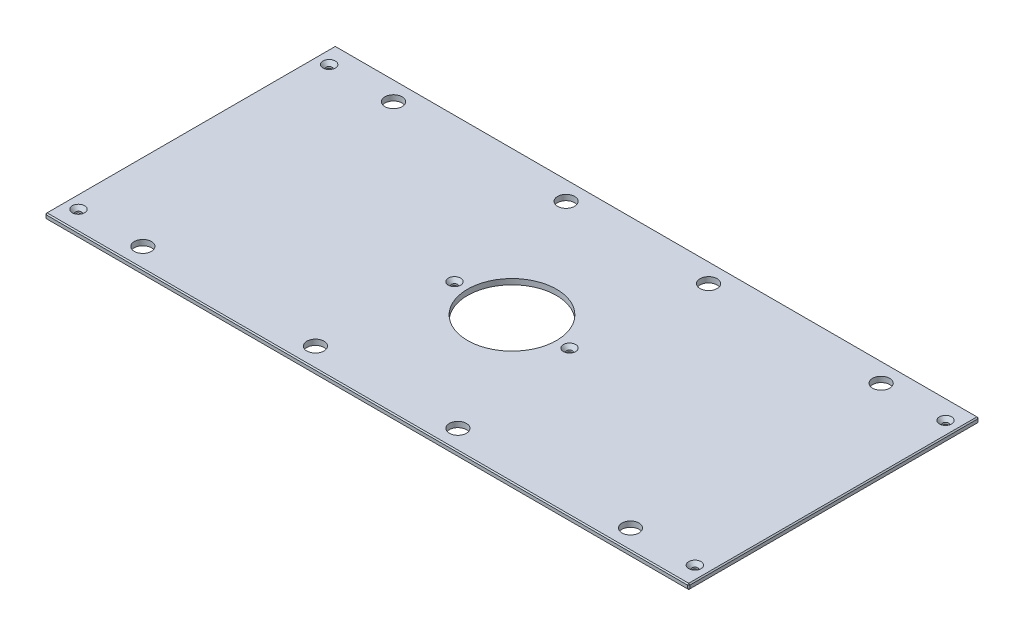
ISO-10303-21;
HEADER;
FILE_DESCRIPTION(('STEP AP214'),'2;1');
FILE_NAME('part.step','',(''),(''),'','','');
FILE_SCHEMA(('AUTOMOTIVE_DESIGN { 1 0 10303 214 1 1 1 1 }'));
ENDSEC;
DATA;
#1=APPLICATION_CONTEXT('core data for automotive mechanical design processes');
#2=APPLICATION_PROTOCOL_DEFINITION('international standard','automotive_design',2000,#1);
#3=PRODUCT_CONTEXT('',#1,'mechanical');
#4=PRODUCT('Part','Part','',(#3));
#5=PRODUCT_RELATED_PRODUCT_CATEGORY('part','',(#4));
#6=PRODUCT_DEFINITION_FORMATION('','',#4);
#7=PRODUCT_DEFINITION_CONTEXT('part definition',#1,'design');
#8=PRODUCT_DEFINITION('design','',#6,#7);
#9=PRODUCT_DEFINITION_SHAPE('','',#8);
#10=(LENGTH_UNIT() NAMED_UNIT(*) SI_UNIT(.MILLI.,.METRE.));
#11=(NAMED_UNIT(*) PLANE_ANGLE_UNIT() SI_UNIT($,.RADIAN.));
#12=(NAMED_UNIT(*) SI_UNIT($,.STERADIAN.) SOLID_ANGLE_UNIT());
#13=UNCERTAINTY_MEASURE_WITH_UNIT(LENGTH_MEASURE(1.E-05),#10,'distance_accuracy_value','');
#14=(GEOMETRIC_REPRESENTATION_CONTEXT(3) GLOBAL_UNCERTAINTY_ASSIGNED_CONTEXT((#13)) GLOBAL_UNIT_ASSIGNED_CONTEXT((#10,
#11,#12)) REPRESENTATION_CONTEXT('',''));
#15=CARTESIAN_POINT('',(0.,0.,0.));
#16=DIRECTION('',(0.,0.,1.));
#17=DIRECTION('',(1.,0.,0.));
#18=AXIS2_PLACEMENT_3D('',#15,#16,#17);
#19=CARTESIAN_POINT('',(-373.0625,6.35,-168.275));
#20=DIRECTION('',(1.,0.,0.));
#21=DIRECTION('',(0.,0.,-1.));
#22=AXIS2_PLACEMENT_3D('',#19,#20,#21);
#23=PLANE('',#22);
#24=DIRECTION('',(0.,0.,-1.));
#25=VECTOR('',#24,1.);
#26=CARTESIAN_POINT('',(-373.0625,5.08000000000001,-168.275));
#27=LINE('',#26,#25);
#28=CARTESIAN_POINT('',(-373.0625,5.08000000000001,167.005));
#29=VERTEX_POINT('',#28);
#30=CARTESIAN_POINT('',(-373.0625,5.08000000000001,-167.005));
#31=VERTEX_POINT('',#30);
#32=EDGE_CURVE('E140',#29,#31,#27,.T.);
#33=ORIENTED_EDGE('',*,*,#32,.T.);
#34=DIRECTION('',(0.,-1.,0.));
#35=VECTOR('',#34,1.);
#36=CARTESIAN_POINT('',(-373.0625,6.35,-167.005));
#37=LINE('',#36,#35);
#38=CARTESIAN_POINT('',(-373.0625,1.26999999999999,-167.005));
#39=VERTEX_POINT('',#38);
#40=EDGE_CURVE('E135',#31,#39,#37,.T.);
#41=ORIENTED_EDGE('',*,*,#40,.T.);
#42=DIRECTION('',(0.,0.,1.));
#43=VECTOR('',#42,1.);
#44=CARTESIAN_POINT('',(-373.0625,1.26999999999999,-168.275));
#45=LINE('',#44,#43);
#46=CARTESIAN_POINT('',(-373.0625,1.26999999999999,167.005));
#47=VERTEX_POINT('',#46);
#48=EDGE_CURVE('E130',#39,#47,#45,.T.);
#49=ORIENTED_EDGE('',*,*,#48,.T.);
#50=DIRECTION('',(0.,1.,0.));
#51=VECTOR('',#50,1.);
#52=CARTESIAN_POINT('',(-373.0625,6.35,167.005));
#53=LINE('',#52,#51);
#54=EDGE_CURVE('E132',#47,#29,#53,.T.);
#55=ORIENTED_EDGE('',*,*,#54,.T.);
#56=EDGE_LOOP('',(#33,#41,#49,#55));
#57=FACE_BOUND('',#56,.T.);
#58=ADVANCED_FACE('F38',(#57),#23,.F.);
#59=CARTESIAN_POINT('',(-373.0625,6.35,168.275));
#60=DIRECTION('',(0.,0.,-1.));
#61=DIRECTION('',(-1.,0.,0.));
#62=AXIS2_PLACEMENT_3D('',#59,#60,#61);
#63=PLANE('',#62);
#64=DIRECTION('',(1.,0.,0.));
#65=VECTOR('',#64,1.);
#66=CARTESIAN_POINT('',(-373.0625,1.26999999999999,168.275));
#67=LINE('',#66,#65);
#68=CARTESIAN_POINT('',(-371.7925,1.26999999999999,168.275));
#69=VERTEX_POINT('',#68);
#70=CARTESIAN_POINT('',(371.7925,1.26999999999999,168.275));
#71=VERTEX_POINT('',#70);
#72=EDGE_CURVE('E62',#69,#71,#67,.T.);
#73=ORIENTED_EDGE('',*,*,#72,.T.);
#74=DIRECTION('',(0.,1.,0.));
#75=VECTOR('',#74,1.);
#76=CARTESIAN_POINT('',(371.7925,6.35,168.275));
#77=LINE('',#76,#75);
#78=CARTESIAN_POINT('',(371.7925,5.08000000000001,168.275));
#79=VERTEX_POINT('',#78);
#80=EDGE_CURVE('E11',#71,#79,#77,.T.);
#81=ORIENTED_EDGE('',*,*,#80,.T.);
#82=DIRECTION('',(-1.,0.,0.));
#83=VECTOR('',#82,1.);
#84=CARTESIAN_POINT('',(-373.0625,5.08000000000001,168.275));
#85=LINE('',#84,#83);
#86=CARTESIAN_POINT('',(-371.7925,5.08000000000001,168.275));
#87=VERTEX_POINT('',#86);
#88=EDGE_CURVE('E48',#79,#87,#85,.T.);
#89=ORIENTED_EDGE('',*,*,#88,.T.);
#90=DIRECTION('',(0.,-1.,0.));
#91=VECTOR('',#90,1.);
#92=CARTESIAN_POINT('',(-371.7925,6.35,168.275));
#93=LINE('',#92,#91);
#94=EDGE_CURVE('E366',#87,#69,#93,.T.);
#95=ORIENTED_EDGE('',*,*,#94,.T.);
#96=EDGE_LOOP('',(#73,#81,#89,#95));
#97=FACE_BOUND('',#96,.T.);
#98=ADVANCED_FACE('F442',(#97),#63,.F.);
#99=CARTESIAN_POINT('',(373.0625,6.35,-168.275));
#100=DIRECTION('',(-1.,0.,0.));
#101=DIRECTION('',(0.,0.,1.));
#102=AXIS2_PLACEMENT_3D('',#99,#100,#101);
#103=PLANE('',#102);
#104=DIRECTION('',(0.,0.,-1.));
#105=VECTOR('',#104,1.);
#106=CARTESIAN_POINT('',(373.0625,1.26999999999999,-168.275));
#107=LINE('',#106,#105);
#108=CARTESIAN_POINT('',(373.0625,1.26999999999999,167.005));
#109=VERTEX_POINT('',#108);
#110=CARTESIAN_POINT('',(373.0625,1.26999999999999,-167.005));
#111=VERTEX_POINT('',#110);
#112=EDGE_CURVE('E359',#109,#111,#107,.T.);
#113=ORIENTED_EDGE('',*,*,#112,.T.);
#114=DIRECTION('',(0.,1.,0.));
#115=VECTOR('',#114,1.);
#116=CARTESIAN_POINT('',(373.0625,6.35,-167.005));
#117=LINE('',#116,#115);
#118=CARTESIAN_POINT('',(373.0625,5.08000000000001,-167.005));
#119=VERTEX_POINT('',#118);
#120=EDGE_CURVE('E362',#111,#119,#117,.T.);
#121=ORIENTED_EDGE('',*,*,#120,.T.);
#122=DIRECTION('',(0.,0.,1.));
#123=VECTOR('',#122,1.);
#124=CARTESIAN_POINT('',(373.0625,5.08000000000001,168.275));
#125=LINE('',#124,#123);
#126=CARTESIAN_POINT('',(373.0625,5.08000000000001,167.005));
#127=VERTEX_POINT('',#126);
#128=EDGE_CURVE('E356',#119,#127,#125,.T.);
#129=ORIENTED_EDGE('',*,*,#128,.T.);
#130=DIRECTION('',(0.,-1.,0.));
#131=VECTOR('',#130,1.);
#132=CARTESIAN_POINT('',(373.0625,6.35,167.005));
#133=LINE('',#132,#131);
#134=EDGE_CURVE('E353',#127,#109,#133,.T.);
#135=ORIENTED_EDGE('',*,*,#134,.T.);
#136=EDGE_LOOP('',(#113,#121,#129,#135));
#137=FACE_BOUND('',#136,.T.);
#138=ADVANCED_FACE('F429',(#137),#103,.F.);
#139=CARTESIAN_POINT('',(-373.0625,6.35,-168.275));
#140=DIRECTION('',(0.,0.,1.));
#141=DIRECTION('',(1.,0.,0.));
#142=AXIS2_PLACEMENT_3D('',#139,#140,#141);
#143=PLANE('',#142);
#144=DIRECTION('',(-1.,0.,0.));
#145=VECTOR('',#144,1.);
#146=CARTESIAN_POINT('',(-373.0625,1.26999999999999,-168.275));
#147=LINE('',#146,#145);
#148=CARTESIAN_POINT('',(371.7925,1.26999999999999,-168.275));
#149=VERTEX_POINT('',#148);
#150=CARTESIAN_POINT('',(-371.7925,1.26999999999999,-168.275));
#151=VERTEX_POINT('',#150);
#152=EDGE_CURVE('E320',#149,#151,#147,.T.);
#153=ORIENTED_EDGE('',*,*,#152,.T.);
#154=DIRECTION('',(0.,1.,0.));
#155=VECTOR('',#154,1.);
#156=CARTESIAN_POINT('',(-371.7925,6.35,-168.275));
#157=LINE('',#156,#155);
#158=CARTESIAN_POINT('',(-371.7925,5.08000000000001,-168.275));
#159=VERTEX_POINT('',#158);
#160=EDGE_CURVE('E326',#151,#159,#157,.T.);
#161=ORIENTED_EDGE('',*,*,#160,.T.);
#162=DIRECTION('',(1.,0.,0.));
#163=VECTOR('',#162,1.);
#164=CARTESIAN_POINT('',(373.0625,5.08000000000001,-168.275));
#165=LINE('',#164,#163);
#166=CARTESIAN_POINT('',(371.7925,5.08000000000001,-168.275));
#167=VERTEX_POINT('',#166);
#168=EDGE_CURVE('E323',#159,#167,#165,.T.);
#169=ORIENTED_EDGE('',*,*,#168,.T.);
#170=DIRECTION('',(0.,-1.,0.));
#171=VECTOR('',#170,1.);
#172=CARTESIAN_POINT('',(371.7925,6.35,-168.275));
#173=LINE('',#172,#171);
#174=EDGE_CURVE('E317',#167,#149,#173,.T.);
#175=ORIENTED_EDGE('',*,*,#174,.T.);
#176=EDGE_LOOP('',(#153,#161,#169,#175));
#177=FACE_BOUND('',#176,.T.);
#178=ADVANCED_FACE('F403',(#177),#143,.F.);
#179=CARTESIAN_POINT('',(0.,6.35,0.));
#180=DIRECTION('',(0.,1.,0.));
#181=DIRECTION('',(0.,0.,1.));
#182=AXIS2_PLACEMENT_3D('',#179,#180,#181);
#183=PLANE('',#182);
#184=CARTESIAN_POINT('',(357.1875,6.35,-145.25498));
#185=DIRECTION('',(0.,1.,0.));
#186=DIRECTION('',(0.,0.,1.));
#187=AXIS2_PLACEMENT_3D('',#184,#185,#186);
#188=CIRCLE('',#187,7.13740000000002);
#189=CARTESIAN_POINT('',(357.1875,6.35,-138.11758));
#190=VERTEX_POINT('',#189);
#191=EDGE_CURVE('E974',#190,#190,#188,.T.);
#192=ORIENTED_EDGE('',*,*,#191,.F.);
#193=EDGE_LOOP('',(#192));
#194=FACE_BOUND('',#193,.T.);
#195=CARTESIAN_POINT('',(357.1875,6.35,145.25498));
#196=DIRECTION('',(0.,1.,0.));
#197=DIRECTION('',(0.,0.,1.));
#198=AXIS2_PLACEMENT_3D('',#195,#196,#197);
#199=CIRCLE('',#198,7.13740000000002);
#200=CARTESIAN_POINT('',(357.1875,6.35,152.39238));
#201=VERTEX_POINT('',#200);
#202=EDGE_CURVE('E978',#201,#201,#199,.T.);
#203=ORIENTED_EDGE('',*,*,#202,.F.);
#204=EDGE_LOOP('',(#203));
#205=FACE_BOUND('',#204,.T.);
#206=CARTESIAN_POINT('',(-357.1875,6.35,145.25498));
#207=DIRECTION('',(0.,1.,0.));
#208=DIRECTION('',(0.,0.,1.));
#209=AXIS2_PLACEMENT_3D('',#206,#207,#208);
#210=CIRCLE('',#209,7.13740000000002);
#211=CARTESIAN_POINT('',(-357.1875,6.35,152.39238));
#212=VERTEX_POINT('',#211);
#213=EDGE_CURVE('E982',#212,#212,#210,.T.);
#214=ORIENTED_EDGE('',*,*,#213,.F.);
#215=EDGE_LOOP('',(#214));
#216=FACE_BOUND('',#215,.T.);
#217=CARTESIAN_POINT('',(-66.675,6.35,0.));
#218=DIRECTION('',(0.,1.,0.));
#219=DIRECTION('',(0.,0.,1.));
#220=AXIS2_PLACEMENT_3D('',#217,#218,#219);
#221=CIRCLE('',#220,7.1374);
#222=CARTESIAN_POINT('',(-66.675,6.35,7.1374));
#223=VERTEX_POINT('',#222);
#224=EDGE_CURVE('E986',#223,#223,#221,.T.);
#225=ORIENTED_EDGE('',*,*,#224,.F.);
#226=EDGE_LOOP('',(#225));
#227=FACE_BOUND('',#226,.T.);
#228=CARTESIAN_POINT('',(66.675,6.35,0.));
#229=DIRECTION('',(0.,1.,0.));
#230=DIRECTION('',(0.,0.,1.));
#231=AXIS2_PLACEMENT_3D('',#228,#229,#230);
#232=CIRCLE('',#231,7.1374);
#233=CARTESIAN_POINT('',(66.675,6.35,7.1374));
#234=VERTEX_POINT('',#233);
#235=EDGE_CURVE('E990',#234,#234,#232,.T.);
#236=ORIENTED_EDGE('',*,*,#235,.F.);
#237=EDGE_LOOP('',(#236));
#238=FACE_BOUND('',#237,.T.);
#239=CARTESIAN_POINT('',(-357.1875,6.35,-145.25498));
#240=DIRECTION('',(0.,1.,0.));
#241=DIRECTION('',(0.,0.,1.));
#242=AXIS2_PLACEMENT_3D('',#239,#240,#241);
#243=CIRCLE('',#242,7.13740000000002);
#244=CARTESIAN_POINT('',(-357.1875,6.35,-138.11758));
#245=VERTEX_POINT('',#244);
#246=EDGE_CURVE('E993',#245,#245,#243,.T.);
#247=ORIENTED_EDGE('',*,*,#246,.F.);
#248=EDGE_LOOP('',(#247));
#249=FACE_BOUND('',#248,.T.);
#250=DIRECTION('',(0.,0.,-1.));
#251=VECTOR('',#250,1.);
#252=CARTESIAN_POINT('',(371.7925,6.35,-168.275));
#253=LINE('',#252,#251);
#254=CARTESIAN_POINT('',(371.7925,6.35,167.005));
#255=VERTEX_POINT('',#254);
#256=CARTESIAN_POINT('',(371.7925,6.35,-167.005));
#257=VERTEX_POINT('',#256);
#258=EDGE_CURVE('E335',#255,#257,#253,.T.);
#259=ORIENTED_EDGE('',*,*,#258,.T.);
#260=DIRECTION('',(-1.,0.,0.));
#261=VECTOR('',#260,1.);
#262=CARTESIAN_POINT('',(-373.0625,6.35,-167.005));
#263=LINE('',#262,#261);
#264=CARTESIAN_POINT('',(-371.7925,6.35,-167.005));
#265=VERTEX_POINT('',#264);
#266=EDGE_CURVE('E337',#257,#265,#263,.T.);
#267=ORIENTED_EDGE('',*,*,#266,.T.);
#268=DIRECTION('',(0.,0.,1.));
#269=VECTOR('',#268,1.);
#270=CARTESIAN_POINT('',(-371.7925,6.35,168.275));
#271=LINE('',#270,#269);
#272=CARTESIAN_POINT('',(-371.7925,6.35,167.005));
#273=VERTEX_POINT('',#272);
#274=EDGE_CURVE('E332',#265,#273,#271,.T.);
#275=ORIENTED_EDGE('',*,*,#274,.T.);
#276=DIRECTION('',(1.,0.,0.));
#277=VECTOR('',#276,1.);
#278=CARTESIAN_POINT('',(373.0625,6.35,167.005));
#279=LINE('',#278,#277);
#280=EDGE_CURVE('E330',#273,#255,#279,.T.);
#281=ORIENTED_EDGE('',*,*,#280,.T.);
#282=EDGE_LOOP('',(#259,#267,#275,#281));
#283=FACE_BOUND('',#282,.T.);
#284=CARTESIAN_POINT('',(282.575,6.35,-145.25498));
#285=DIRECTION('',(0.,1.,0.));
#286=DIRECTION('',(0.,0.,1.));
#287=AXIS2_PLACEMENT_3D('',#284,#285,#286);
#288=CIRCLE('',#287,9.92187500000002);
#289=CARTESIAN_POINT('',(282.575,6.35,-135.333105));
#290=VERTEX_POINT('',#289);
#291=EDGE_CURVE('E231',#290,#290,#288,.T.);
#292=ORIENTED_EDGE('',*,*,#291,.F.);
#293=EDGE_LOOP('',(#292));
#294=FACE_BOUND('',#293,.T.);
#295=CARTESIAN_POINT('',(-282.575,6.35,-145.25498));
#296=DIRECTION('',(0.,1.,0.));
#297=DIRECTION('',(0.,0.,1.));
#298=AXIS2_PLACEMENT_3D('',#295,#296,#297);
#299=CIRCLE('',#298,9.92187500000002);
#300=CARTESIAN_POINT('',(-282.575,6.35,-135.333105));
#301=VERTEX_POINT('',#300);
#302=EDGE_CURVE('E246',#301,#301,#299,.T.);
#303=ORIENTED_EDGE('',*,*,#302,.F.);
#304=EDGE_LOOP('',(#303));
#305=FACE_BOUND('',#304,.T.);
#306=CARTESIAN_POINT('',(282.575,6.35,145.25498));
#307=DIRECTION('',(0.,1.,0.));
#308=DIRECTION('',(0.,0.,1.));
#309=AXIS2_PLACEMENT_3D('',#306,#307,#308);
#310=CIRCLE('',#309,9.92187500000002);
#311=CARTESIAN_POINT('',(282.575,6.35,155.176855));
#312=VERTEX_POINT('',#311);
#313=EDGE_CURVE('E259',#312,#312,#310,.T.);
#314=ORIENTED_EDGE('',*,*,#313,.F.);
#315=EDGE_LOOP('',(#314));
#316=FACE_BOUND('',#315,.T.);
#317=CARTESIAN_POINT('',(-282.575,6.35,145.25498));
#318=DIRECTION('',(0.,1.,0.));
#319=DIRECTION('',(0.,0.,1.));
#320=AXIS2_PLACEMENT_3D('',#317,#318,#319);
#321=CIRCLE('',#320,9.92187500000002);
#322=CARTESIAN_POINT('',(-282.575,6.35,155.176855));
#323=VERTEX_POINT('',#322);
#324=EDGE_CURVE('E267',#323,#323,#321,.T.);
#325=ORIENTED_EDGE('',*,*,#324,.F.);
#326=EDGE_LOOP('',(#325));
#327=FACE_BOUND('',#326,.T.);
#328=CARTESIAN_POINT('',(-82.55,6.35,-145.25498));
#329=DIRECTION('',(0.,1.,0.));
#330=DIRECTION('',(0.,0.,1.));
#331=AXIS2_PLACEMENT_3D('',#328,#329,#330);
#332=CIRCLE('',#331,9.921875);
#333=CARTESIAN_POINT('',(-82.55,6.35,-135.333105));
#334=VERTEX_POINT('',#333);
#335=EDGE_CURVE('E275',#334,#334,#332,.T.);
#336=ORIENTED_EDGE('',*,*,#335,.F.);
#337=EDGE_LOOP('',(#336));
#338=FACE_BOUND('',#337,.T.);
#339=CARTESIAN_POINT('',(82.55,6.35,-145.25498));
#340=DIRECTION('',(0.,1.,0.));
#341=DIRECTION('',(0.,0.,1.));
#342=AXIS2_PLACEMENT_3D('',#339,#340,#341);
#343=CIRCLE('',#342,9.921875);
#344=CARTESIAN_POINT('',(82.55,6.35,-135.333105));
#345=VERTEX_POINT('',#344);
#346=EDGE_CURVE('E283',#345,#345,#343,.T.);
#347=ORIENTED_EDGE('',*,*,#346,.F.);
#348=EDGE_LOOP('',(#347));
#349=FACE_BOUND('',#348,.T.);
#350=CARTESIAN_POINT('',(82.55,6.35,145.25498));
#351=DIRECTION('',(0.,1.,0.));
#352=DIRECTION('',(0.,0.,1.));
#353=AXIS2_PLACEMENT_3D('',#350,#351,#352);
#354=CIRCLE('',#353,9.921875);
#355=CARTESIAN_POINT('',(82.55,6.35,155.176855));
#356=VERTEX_POINT('',#355);
#357=EDGE_CURVE('E291',#356,#356,#354,.T.);
#358=ORIENTED_EDGE('',*,*,#357,.F.);
#359=EDGE_LOOP('',(#358));
#360=FACE_BOUND('',#359,.T.);
#361=CARTESIAN_POINT('',(-82.55,6.35,145.25498));
#362=DIRECTION('',(0.,1.,0.));
#363=DIRECTION('',(0.,0.,1.));
#364=AXIS2_PLACEMENT_3D('',#361,#362,#363);
#365=CIRCLE('',#364,9.921875);
#366=CARTESIAN_POINT('',(-82.55,6.35,155.176855));
#367=VERTEX_POINT('',#366);
#368=EDGE_CURVE('E299',#367,#367,#365,.T.);
#369=ORIENTED_EDGE('',*,*,#368,.F.);
#370=EDGE_LOOP('',(#369));
#371=FACE_BOUND('',#370,.T.);
#372=CARTESIAN_POINT('',(0.,6.35,0.));
#373=DIRECTION('',(0.,1.,0.));
#374=DIRECTION('',(0.,0.,1.));
#375=AXIS2_PLACEMENT_3D('',#372,#373,#374);
#376=CIRCLE('',#375,51.562);
#377=CARTESIAN_POINT('',(0.,6.35,51.562));
#378=VERTEX_POINT('',#377);
#379=EDGE_CURVE('E307',#378,#378,#376,.T.);
#380=ORIENTED_EDGE('',*,*,#379,.F.);
#381=EDGE_LOOP('',(#380));
#382=FACE_BOUND('',#381,.T.);
#383=ADVANCED_FACE('F451',(#194,#205,#216,#227,#238,#249,#283,#294,#305,#316,#327,#338,#349,
#360,#371,#382),#183,.T.);
#384=CARTESIAN_POINT('',(0.,0.,0.));
#385=DIRECTION('',(0.,1.,0.));
#386=DIRECTION('',(0.,0.,1.));
#387=AXIS2_PLACEMENT_3D('',#384,#385,#386);
#388=PLANE('',#387);
#389=CARTESIAN_POINT('',(357.1875,0.,-145.25498));
#390=DIRECTION('',(0.,1.,0.));
#391=DIRECTION('',(0.,0.,1.));
#392=AXIS2_PLACEMENT_3D('',#389,#390,#391);
#393=CIRCLE('',#392,3.3782);
#394=CARTESIAN_POINT('',(357.1875,0.,-141.87678));
#395=VERTEX_POINT('',#394);
#396=EDGE_CURVE('E1041',#395,#395,#393,.T.);
#397=ORIENTED_EDGE('',*,*,#396,.T.);
#398=EDGE_LOOP('',(#397));
#399=FACE_BOUND('',#398,.T.);
#400=CARTESIAN_POINT('',(357.1875,0.,145.25498));
#401=DIRECTION('',(0.,1.,0.));
#402=DIRECTION('',(0.,0.,1.));
#403=AXIS2_PLACEMENT_3D('',#400,#401,#402);
#404=CIRCLE('',#403,3.3782);
#405=CARTESIAN_POINT('',(357.1875,0.,148.63318));
#406=VERTEX_POINT('',#405);
#407=EDGE_CURVE('E1031',#406,#406,#404,.T.);
#408=ORIENTED_EDGE('',*,*,#407,.T.);
#409=EDGE_LOOP('',(#408));
#410=FACE_BOUND('',#409,.T.);
#411=CARTESIAN_POINT('',(-357.1875,0.,145.25498));
#412=DIRECTION('',(0.,1.,0.));
#413=DIRECTION('',(0.,0.,1.));
#414=AXIS2_PLACEMENT_3D('',#411,#412,#413);
#415=CIRCLE('',#414,3.3782);
#416=CARTESIAN_POINT('',(-357.1875,0.,148.63318));
#417=VERTEX_POINT('',#416);
#418=EDGE_CURVE('E1021',#417,#417,#415,.T.);
#419=ORIENTED_EDGE('',*,*,#418,.T.);
#420=EDGE_LOOP('',(#419));
#421=FACE_BOUND('',#420,.T.);
#422=CARTESIAN_POINT('',(-66.675,0.,0.));
#423=DIRECTION('',(0.,1.,0.));
#424=DIRECTION('',(0.,0.,1.));
#425=AXIS2_PLACEMENT_3D('',#422,#423,#424);
#426=CIRCLE('',#425,3.3782);
#427=CARTESIAN_POINT('',(-66.675,0.,3.3782));
#428=VERTEX_POINT('',#427);
#429=EDGE_CURVE('E1011',#428,#428,#426,.T.);
#430=ORIENTED_EDGE('',*,*,#429,.T.);
#431=EDGE_LOOP('',(#430));
#432=FACE_BOUND('',#431,.T.);
#433=CARTESIAN_POINT('',(66.675,0.,0.));
#434=DIRECTION('',(0.,1.,0.));
#435=DIRECTION('',(0.,0.,1.));
#436=AXIS2_PLACEMENT_3D('',#433,#434,#435);
#437=CIRCLE('',#436,3.3782);
#438=CARTESIAN_POINT('',(66.675,0.,3.3782));
#439=VERTEX_POINT('',#438);
#440=EDGE_CURVE('E997',#439,#439,#437,.T.);
#441=ORIENTED_EDGE('',*,*,#440,.T.);
#442=EDGE_LOOP('',(#441));
#443=FACE_BOUND('',#442,.T.);
#444=CARTESIAN_POINT('',(-357.1875,0.,-145.25498));
#445=DIRECTION('',(0.,1.,0.));
#446=DIRECTION('',(0.,0.,1.));
#447=AXIS2_PLACEMENT_3D('',#444,#445,#446);
#448=CIRCLE('',#447,3.3782);
#449=CARTESIAN_POINT('',(-357.1875,0.,-141.87678));
#450=VERTEX_POINT('',#449);
#451=EDGE_CURVE('E249',#450,#450,#448,.T.);
#452=ORIENTED_EDGE('',*,*,#451,.T.);
#453=EDGE_LOOP('',(#452));
#454=FACE_BOUND('',#453,.T.);
#455=DIRECTION('',(0.,0.,-1.));
#456=VECTOR('',#455,1.);
#457=CARTESIAN_POINT('',(-371.7925,0.,0.));
#458=LINE('',#457,#456);
#459=CARTESIAN_POINT('',(-371.7925,0.,167.005));
#460=VERTEX_POINT('',#459);
#461=CARTESIAN_POINT('',(-371.7925,0.,-167.005));
#462=VERTEX_POINT('',#461);
#463=EDGE_CURVE('E165',#460,#462,#458,.T.);
#464=ORIENTED_EDGE('',*,*,#463,.T.);
#465=DIRECTION('',(1.,0.,0.));
#466=VECTOR('',#465,1.);
#467=CARTESIAN_POINT('',(0.,0.,-167.005));
#468=LINE('',#467,#466);
#469=CARTESIAN_POINT('',(371.7925,0.,-167.005));
#470=VERTEX_POINT('',#469);
#471=EDGE_CURVE('E349',#462,#470,#468,.T.);
#472=ORIENTED_EDGE('',*,*,#471,.T.);
#473=DIRECTION('',(0.,0.,1.));
#474=VECTOR('',#473,1.);
#475=CARTESIAN_POINT('',(371.7925,0.,0.));
#476=LINE('',#475,#474);
#477=CARTESIAN_POINT('',(371.7925,0.,167.005));
#478=VERTEX_POINT('',#477);
#479=EDGE_CURVE('E346',#470,#478,#476,.T.);
#480=ORIENTED_EDGE('',*,*,#479,.T.);
#481=DIRECTION('',(-1.,0.,0.));
#482=VECTOR('',#481,1.);
#483=CARTESIAN_POINT('',(0.,0.,167.005));
#484=LINE('',#483,#482);
#485=EDGE_CURVE('E341',#478,#460,#484,.T.);
#486=ORIENTED_EDGE('',*,*,#485,.T.);
#487=EDGE_LOOP('',(#464,#472,#480,#486));
#488=FACE_BOUND('',#487,.T.);
#489=CARTESIAN_POINT('',(282.575,0.,-145.25498));
#490=DIRECTION('',(0.,1.,0.));
#491=DIRECTION('',(0.,0.,1.));
#492=AXIS2_PLACEMENT_3D('',#489,#490,#491);
#493=CIRCLE('',#492,9.92187500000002);
#494=CARTESIAN_POINT('',(282.575,0.,-135.333105));
#495=VERTEX_POINT('',#494);
#496=EDGE_CURVE('E239',#495,#495,#493,.T.);
#497=ORIENTED_EDGE('',*,*,#496,.T.);
#498=EDGE_LOOP('',(#497));
#499=FACE_BOUND('',#498,.T.);
#500=CARTESIAN_POINT('',(-282.575,0.,-145.25498));
#501=DIRECTION('',(0.,1.,0.));
#502=DIRECTION('',(0.,0.,1.));
#503=AXIS2_PLACEMENT_3D('',#500,#501,#502);
#504=CIRCLE('',#503,9.92187500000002);
#505=CARTESIAN_POINT('',(-282.575,0.,-135.333105));
#506=VERTEX_POINT('',#505);
#507=EDGE_CURVE('E255',#506,#506,#504,.T.);
#508=ORIENTED_EDGE('',*,*,#507,.T.);
#509=EDGE_LOOP('',(#508));
#510=FACE_BOUND('',#509,.T.);
#511=CARTESIAN_POINT('',(282.575,0.,145.25498));
#512=DIRECTION('',(0.,1.,0.));
#513=DIRECTION('',(0.,0.,1.));
#514=AXIS2_PLACEMENT_3D('',#511,#512,#513);
#515=CIRCLE('',#514,9.92187500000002);
#516=CARTESIAN_POINT('',(282.575,0.,155.176855));
#517=VERTEX_POINT('',#516);
#518=EDGE_CURVE('E263',#517,#517,#515,.T.);
#519=ORIENTED_EDGE('',*,*,#518,.T.);
#520=EDGE_LOOP('',(#519));
#521=FACE_BOUND('',#520,.T.);
#522=CARTESIAN_POINT('',(-282.575,0.,145.25498));
#523=DIRECTION('',(0.,1.,0.));
#524=DIRECTION('',(0.,0.,1.));
#525=AXIS2_PLACEMENT_3D('',#522,#523,#524);
#526=CIRCLE('',#525,9.92187500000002);
#527=CARTESIAN_POINT('',(-282.575,0.,155.176855));
#528=VERTEX_POINT('',#527);
#529=EDGE_CURVE('E271',#528,#528,#526,.T.);
#530=ORIENTED_EDGE('',*,*,#529,.T.);
#531=EDGE_LOOP('',(#530));
#532=FACE_BOUND('',#531,.T.);
#533=CARTESIAN_POINT('',(-82.55,0.,-145.25498));
#534=DIRECTION('',(0.,1.,0.));
#535=DIRECTION('',(0.,0.,1.));
#536=AXIS2_PLACEMENT_3D('',#533,#534,#535);
#537=CIRCLE('',#536,9.921875);
#538=CARTESIAN_POINT('',(-82.55,0.,-135.333105));
#539=VERTEX_POINT('',#538);
#540=EDGE_CURVE('E279',#539,#539,#537,.T.);
#541=ORIENTED_EDGE('',*,*,#540,.T.);
#542=EDGE_LOOP('',(#541));
#543=FACE_BOUND('',#542,.T.);
#544=CARTESIAN_POINT('',(82.55,0.,-145.25498));
#545=DIRECTION('',(0.,1.,0.));
#546=DIRECTION('',(0.,0.,1.));
#547=AXIS2_PLACEMENT_3D('',#544,#545,#546);
#548=CIRCLE('',#547,9.921875);
#549=CARTESIAN_POINT('',(82.55,0.,-135.333105));
#550=VERTEX_POINT('',#549);
#551=EDGE_CURVE('E287',#550,#550,#548,.T.);
#552=ORIENTED_EDGE('',*,*,#551,.T.);
#553=EDGE_LOOP('',(#552));
#554=FACE_BOUND('',#553,.T.);
#555=CARTESIAN_POINT('',(82.55,0.,145.25498));
#556=DIRECTION('',(0.,1.,0.));
#557=DIRECTION('',(0.,0.,1.));
#558=AXIS2_PLACEMENT_3D('',#555,#556,#557);
#559=CIRCLE('',#558,9.921875);
#560=CARTESIAN_POINT('',(82.55,0.,155.176855));
#561=VERTEX_POINT('',#560);
#562=EDGE_CURVE('E295',#561,#561,#559,.T.);
#563=ORIENTED_EDGE('',*,*,#562,.T.);
#564=EDGE_LOOP('',(#563));
#565=FACE_BOUND('',#564,.T.);
#566=CARTESIAN_POINT('',(-82.55,0.,145.25498));
#567=DIRECTION('',(0.,1.,0.));
#568=DIRECTION('',(0.,0.,1.));
#569=AXIS2_PLACEMENT_3D('',#566,#567,#568);
#570=CIRCLE('',#569,9.921875);
#571=CARTESIAN_POINT('',(-82.55,0.,155.176855));
#572=VERTEX_POINT('',#571);
#573=EDGE_CURVE('E303',#572,#572,#570,.T.);
#574=ORIENTED_EDGE('',*,*,#573,.T.);
#575=EDGE_LOOP('',(#574));
#576=FACE_BOUND('',#575,.T.);
#577=CARTESIAN_POINT('',(0.,0.,0.));
#578=DIRECTION('',(0.,1.,0.));
#579=DIRECTION('',(0.,0.,1.));
#580=AXIS2_PLACEMENT_3D('',#577,#578,#579);
#581=CIRCLE('',#580,51.562);
#582=CARTESIAN_POINT('',(0.,0.,51.562));
#583=VERTEX_POINT('',#582);
#584=EDGE_CURVE('E153',#583,#583,#581,.T.);
#585=ORIENTED_EDGE('',*,*,#584,.T.);
#586=EDGE_LOOP('',(#585));
#587=FACE_BOUND('',#586,.T.);
#588=ADVANCED_FACE('F416',(#399,#410,#421,#432,#443,#454,#488,#499,#510,#521,#532,#543,#554,
#565,#576,#587),#388,.F.);
#589=CARTESIAN_POINT('',(0.,0.,0.));
#590=DIRECTION('',(0.,1.,0.));
#591=DIRECTION('',(0.,0.,1.));
#592=AXIS2_PLACEMENT_3D('',#589,#590,#591);
#593=CYLINDRICAL_SURFACE('',#592,51.562);
#594=ORIENTED_EDGE('',*,*,#584,.F.);
#595=EDGE_LOOP('',(#594));
#596=FACE_BOUND('',#595,.T.);
#597=ORIENTED_EDGE('',*,*,#379,.T.);
#598=EDGE_LOOP('',(#597));
#599=FACE_BOUND('',#598,.T.);
#600=ADVANCED_FACE('F697',(#596,#599),#593,.F.);
#601=CARTESIAN_POINT('',(-82.55,6.35,145.25498));
#602=DIRECTION('',(0.,1.,0.));
#603=DIRECTION('',(0.,0.,1.));
#604=AXIS2_PLACEMENT_3D('',#601,#602,#603);
#605=CYLINDRICAL_SURFACE('',#604,9.921875);
#606=ORIENTED_EDGE('',*,*,#573,.F.);
#607=EDGE_LOOP('',(#606));
#608=FACE_BOUND('',#607,.T.);
#609=ORIENTED_EDGE('',*,*,#368,.T.);
#610=EDGE_LOOP('',(#609));
#611=FACE_BOUND('',#610,.T.);
#612=ADVANCED_FACE('F891',(#608,#611),#605,.F.);
#613=CARTESIAN_POINT('',(82.55,6.35,145.25498));
#614=DIRECTION('',(0.,1.,0.));
#615=DIRECTION('',(0.,0.,1.));
#616=AXIS2_PLACEMENT_3D('',#613,#614,#615);
#617=CYLINDRICAL_SURFACE('',#616,9.921875);
#618=ORIENTED_EDGE('',*,*,#562,.F.);
#619=EDGE_LOOP('',(#618));
#620=FACE_BOUND('',#619,.T.);
#621=ORIENTED_EDGE('',*,*,#357,.T.);
#622=EDGE_LOOP('',(#621));
#623=FACE_BOUND('',#622,.T.);
#624=ADVANCED_FACE('F881',(#620,#623),#617,.F.);
#625=CARTESIAN_POINT('',(82.55,6.35,-145.25498));
#626=DIRECTION('',(0.,1.,0.));
#627=DIRECTION('',(0.,0.,1.));
#628=AXIS2_PLACEMENT_3D('',#625,#626,#627);
#629=CYLINDRICAL_SURFACE('',#628,9.921875);
#630=ORIENTED_EDGE('',*,*,#551,.F.);
#631=EDGE_LOOP('',(#630));
#632=FACE_BOUND('',#631,.T.);
#633=ORIENTED_EDGE('',*,*,#346,.T.);
#634=EDGE_LOOP('',(#633));
#635=FACE_BOUND('',#634,.T.);
#636=ADVANCED_FACE('F871',(#632,#635),#629,.F.);
#637=CARTESIAN_POINT('',(-82.55,6.35,-145.25498));
#638=DIRECTION('',(0.,1.,0.));
#639=DIRECTION('',(0.,0.,1.));
#640=AXIS2_PLACEMENT_3D('',#637,#638,#639);
#641=CYLINDRICAL_SURFACE('',#640,9.921875);
#642=ORIENTED_EDGE('',*,*,#540,.F.);
#643=EDGE_LOOP('',(#642));
#644=FACE_BOUND('',#643,.T.);
#645=ORIENTED_EDGE('',*,*,#335,.T.);
#646=EDGE_LOOP('',(#645));
#647=FACE_BOUND('',#646,.T.);
#648=ADVANCED_FACE('F861',(#644,#647),#641,.F.);
#649=CARTESIAN_POINT('',(-282.575,6.35,145.25498));
#650=DIRECTION('',(0.,1.,0.));
#651=DIRECTION('',(0.,0.,1.));
#652=AXIS2_PLACEMENT_3D('',#649,#650,#651);
#653=CYLINDRICAL_SURFACE('',#652,9.92187500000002);
#654=ORIENTED_EDGE('',*,*,#529,.F.);
#655=EDGE_LOOP('',(#654));
#656=FACE_BOUND('',#655,.T.);
#657=ORIENTED_EDGE('',*,*,#324,.T.);
#658=EDGE_LOOP('',(#657));
#659=FACE_BOUND('',#658,.T.);
#660=ADVANCED_FACE('F851',(#656,#659),#653,.F.);
#661=CARTESIAN_POINT('',(282.575,6.35,145.25498));
#662=DIRECTION('',(0.,1.,0.));
#663=DIRECTION('',(0.,0.,1.));
#664=AXIS2_PLACEMENT_3D('',#661,#662,#663);
#665=CYLINDRICAL_SURFACE('',#664,9.92187500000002);
#666=ORIENTED_EDGE('',*,*,#518,.F.);
#667=EDGE_LOOP('',(#666));
#668=FACE_BOUND('',#667,.T.);
#669=ORIENTED_EDGE('',*,*,#313,.T.);
#670=EDGE_LOOP('',(#669));
#671=FACE_BOUND('',#670,.T.);
#672=ADVANCED_FACE('F841',(#668,#671),#665,.F.);
#673=CARTESIAN_POINT('',(-282.575,6.35,-145.25498));
#674=DIRECTION('',(0.,1.,0.));
#675=DIRECTION('',(0.,0.,1.));
#676=AXIS2_PLACEMENT_3D('',#673,#674,#675);
#677=CYLINDRICAL_SURFACE('',#676,9.92187500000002);
#678=ORIENTED_EDGE('',*,*,#507,.F.);
#679=EDGE_LOOP('',(#678));
#680=FACE_BOUND('',#679,.T.);
#681=ORIENTED_EDGE('',*,*,#302,.T.);
#682=EDGE_LOOP('',(#681));
#683=FACE_BOUND('',#682,.T.);
#684=ADVANCED_FACE('F831',(#680,#683),#677,.F.);
#685=CARTESIAN_POINT('',(282.575,6.35,-145.25498));
#686=DIRECTION('',(0.,1.,0.));
#687=DIRECTION('',(0.,0.,1.));
#688=AXIS2_PLACEMENT_3D('',#685,#686,#687);
#689=CYLINDRICAL_SURFACE('',#688,9.92187500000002);
#690=ORIENTED_EDGE('',*,*,#496,.F.);
#691=EDGE_LOOP('',(#690));
#692=FACE_BOUND('',#691,.T.);
#693=ORIENTED_EDGE('',*,*,#291,.T.);
#694=EDGE_LOOP('',(#693));
#695=FACE_BOUND('',#694,.T.);
#696=ADVANCED_FACE('F460',(#692,#695),#689,.F.);
#697=CARTESIAN_POINT('',(373.0625,6.35,167.005));
#698=DIRECTION('',(-0.707106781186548,0.,-0.707106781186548));
#699=DIRECTION('',(0.,-1.,0.));
#700=AXIS2_PLACEMENT_3D('',#697,#698,#699);
#701=PLANE('',#700);
#702=DIRECTION('',(-0.707106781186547,0.,0.707106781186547));
#703=VECTOR('',#702,1.);
#704=CARTESIAN_POINT('',(373.0625,5.08000000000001,167.005));
#705=LINE('',#704,#703);
#706=EDGE_CURVE('E42',#79,#127,#705,.F.);
#707=ORIENTED_EDGE('',*,*,#706,.F.);
#708=ORIENTED_EDGE('',*,*,#80,.F.);
#709=DIRECTION('',(0.707106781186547,0.,-0.707106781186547));
#710=VECTOR('',#709,1.);
#711=CARTESIAN_POINT('',(372.4275,1.26999999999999,167.64));
#712=LINE('',#711,#710);
#713=EDGE_CURVE('E221',#109,#71,#712,.F.);
#714=ORIENTED_EDGE('',*,*,#713,.F.);
#715=ORIENTED_EDGE('',*,*,#134,.F.);
#716=EDGE_LOOP('',(#707,#708,#714,#715));
#717=FACE_BOUND('',#716,.T.);
#718=ADVANCED_FACE('F40',(#717),#701,.F.);
#719=CARTESIAN_POINT('',(373.0625,5.08000000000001,167.005));
#720=DIRECTION('',(0.577350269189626,0.577350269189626,0.577350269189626));
#721=DIRECTION('',(0.707106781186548,0.,-0.707106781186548));
#722=AXIS2_PLACEMENT_3D('',#719,#720,#721);
#723=PLANE('',#722);
#724=DIRECTION('',(0.,-0.707106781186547,0.707106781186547));
#725=VECTOR('',#724,1.);
#726=CARTESIAN_POINT('',(371.7925,5.715,167.64));
#727=LINE('',#726,#725);
#728=EDGE_CURVE('E215',#79,#255,#727,.F.);
#729=ORIENTED_EDGE('',*,*,#728,.F.);
#730=ORIENTED_EDGE('',*,*,#706,.T.);
#731=DIRECTION('',(-0.707106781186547,0.707106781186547,0.));
#732=VECTOR('',#731,1.);
#733=CARTESIAN_POINT('',(373.0625,5.08000000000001,167.005));
#734=LINE('',#733,#732);
#735=EDGE_CURVE('E218',#255,#127,#734,.F.);
#736=ORIENTED_EDGE('',*,*,#735,.F.);
#737=EDGE_LOOP('',(#729,#730,#736));
#738=FACE_BOUND('',#737,.T.);
#739=ADVANCED_FACE('F453',(#738),#723,.T.);
#740=CARTESIAN_POINT('',(371.7925,0.,167.005));
#741=DIRECTION('',(0.577350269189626,-0.577350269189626,0.577350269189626));
#742=DIRECTION('',(0.707106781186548,0.,-0.707106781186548));
#743=AXIS2_PLACEMENT_3D('',#740,#741,#742);
#744=PLANE('',#743);
#745=DIRECTION('',(-0.707106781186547,-0.707106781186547,0.));
#746=VECTOR('',#745,1.);
#747=CARTESIAN_POINT('',(371.7925,0.,167.005));
#748=LINE('',#747,#746);
#749=EDGE_CURVE('E207',#109,#478,#748,.T.);
#750=ORIENTED_EDGE('',*,*,#749,.F.);
#751=ORIENTED_EDGE('',*,*,#713,.T.);
#752=DIRECTION('',(0.,0.707106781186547,0.707106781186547));
#753=VECTOR('',#752,1.);
#754=CARTESIAN_POINT('',(371.7925,0.,167.005));
#755=LINE('',#754,#753);
#756=EDGE_CURVE('E211',#478,#71,#755,.T.);
#757=ORIENTED_EDGE('',*,*,#756,.F.);
#758=EDGE_LOOP('',(#750,#751,#757));
#759=FACE_BOUND('',#758,.T.);
#760=ADVANCED_FACE('F422',(#759),#744,.T.);
#761=CARTESIAN_POINT('',(371.7925,6.35,0.));
#762=DIRECTION('',(0.707106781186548,0.707106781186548,0.));
#763=DIRECTION('',(0.,0.,1.));
#764=AXIS2_PLACEMENT_3D('',#761,#762,#763);
#765=PLANE('',#764);
#766=ORIENTED_EDGE('',*,*,#735,.T.);
#767=ORIENTED_EDGE('',*,*,#128,.F.);
#768=DIRECTION('',(0.707106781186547,-0.707106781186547,0.));
#769=VECTOR('',#768,1.);
#770=CARTESIAN_POINT('',(372.4275,5.715,-167.005));
#771=LINE('',#770,#769);
#772=EDGE_CURVE('E200',#257,#119,#771,.T.);
#773=ORIENTED_EDGE('',*,*,#772,.F.);
#774=ORIENTED_EDGE('',*,*,#258,.F.);
#775=EDGE_LOOP('',(#766,#767,#773,#774));
#776=FACE_BOUND('',#775,.T.);
#777=ADVANCED_FACE('F439',(#776),#765,.T.);
#778=CARTESIAN_POINT('',(0.,6.35,167.005));
#779=DIRECTION('',(0.,0.707106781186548,0.707106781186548));
#780=DIRECTION('',(-1.,0.,0.));
#781=AXIS2_PLACEMENT_3D('',#778,#779,#780);
#782=PLANE('',#781);
#783=ORIENTED_EDGE('',*,*,#728,.T.);
#784=ORIENTED_EDGE('',*,*,#280,.F.);
#785=DIRECTION('',(0.,0.707106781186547,-0.707106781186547));
#786=VECTOR('',#785,1.);
#787=CARTESIAN_POINT('',(-371.7925,6.35,167.005));
#788=LINE('',#787,#786);
#789=EDGE_CURVE('E196',#87,#273,#788,.T.);
#790=ORIENTED_EDGE('',*,*,#789,.F.);
#791=ORIENTED_EDGE('',*,*,#88,.F.);
#792=EDGE_LOOP('',(#783,#784,#790,#791));
#793=FACE_BOUND('',#792,.T.);
#794=ADVANCED_FACE('F444',(#793),#782,.T.);
#795=CARTESIAN_POINT('',(-371.7925,6.35,168.275));
#796=DIRECTION('',(0.707106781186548,0.,-0.707106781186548));
#797=DIRECTION('',(0.,-1.,0.));
#798=AXIS2_PLACEMENT_3D('',#795,#796,#797);
#799=PLANE('',#798);
#800=DIRECTION('',(0.707106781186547,0.,0.707106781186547));
#801=VECTOR('',#800,1.);
#802=CARTESIAN_POINT('',(-373.0625,1.26999999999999,167.005));
#803=LINE('',#802,#801);
#804=EDGE_CURVE('E147',#69,#47,#803,.F.);
#805=ORIENTED_EDGE('',*,*,#804,.F.);
#806=ORIENTED_EDGE('',*,*,#94,.F.);
#807=DIRECTION('',(-0.707106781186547,0.,-0.707106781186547));
#808=VECTOR('',#807,1.);
#809=CARTESIAN_POINT('',(-372.4275,5.08000000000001,167.64));
#810=LINE('',#809,#808);
#811=EDGE_CURVE('E150',#29,#87,#810,.F.);
#812=ORIENTED_EDGE('',*,*,#811,.F.);
#813=ORIENTED_EDGE('',*,*,#54,.F.);
#814=EDGE_LOOP('',(#805,#806,#812,#813));
#815=FACE_BOUND('',#814,.T.);
#816=ADVANCED_FACE('F145',(#815),#799,.F.);
#817=CARTESIAN_POINT('',(-373.0625,1.26999999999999,168.275));
#818=DIRECTION('',(0.,0.707106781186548,-0.707106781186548));
#819=DIRECTION('',(1.,0.,0.));
#820=AXIS2_PLACEMENT_3D('',#817,#818,#819);
#821=PLANE('',#820);
#822=ORIENTED_EDGE('',*,*,#756,.T.);
#823=ORIENTED_EDGE('',*,*,#72,.F.);
#824=DIRECTION('',(0.,-0.707106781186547,-0.707106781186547));
#825=VECTOR('',#824,1.);
#826=CARTESIAN_POINT('',(-371.7925,0.634999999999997,167.64));
#827=LINE('',#826,#825);
#828=EDGE_CURVE('E161',#460,#69,#827,.F.);
#829=ORIENTED_EDGE('',*,*,#828,.F.);
#830=ORIENTED_EDGE('',*,*,#485,.F.);
#831=EDGE_LOOP('',(#822,#823,#829,#830));
#832=FACE_BOUND('',#831,.T.);
#833=ADVANCED_FACE('F421',(#832),#821,.F.);
#834=CARTESIAN_POINT('',(373.0625,1.26999999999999,-168.275));
#835=DIRECTION('',(-0.707106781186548,0.707106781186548,0.));
#836=DIRECTION('',(0.,0.,-1.));
#837=AXIS2_PLACEMENT_3D('',#834,#835,#836);
#838=PLANE('',#837);
#839=ORIENTED_EDGE('',*,*,#749,.T.);
#840=ORIENTED_EDGE('',*,*,#479,.F.);
#841=DIRECTION('',(0.707106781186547,0.707106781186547,0.));
#842=VECTOR('',#841,1.);
#843=CARTESIAN_POINT('',(371.7925,0.,-167.005));
#844=LINE('',#843,#842);
#845=EDGE_CURVE('E188',#111,#470,#844,.F.);
#846=ORIENTED_EDGE('',*,*,#845,.F.);
#847=ORIENTED_EDGE('',*,*,#112,.F.);
#848=EDGE_LOOP('',(#839,#840,#846,#847));
#849=FACE_BOUND('',#848,.T.);
#850=ADVANCED_FACE('F426',(#849),#838,.F.);
#851=CARTESIAN_POINT('',(371.7925,6.35,-168.275));
#852=DIRECTION('',(-0.707106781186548,0.,0.707106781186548));
#853=DIRECTION('',(0.,-1.,0.));
#854=AXIS2_PLACEMENT_3D('',#851,#852,#853);
#855=PLANE('',#854);
#856=DIRECTION('',(0.707106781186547,0.,0.707106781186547));
#857=VECTOR('',#856,1.);
#858=CARTESIAN_POINT('',(371.7925,5.08000000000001,-168.275));
#859=LINE('',#858,#857);
#860=EDGE_CURVE('E203',#119,#167,#859,.F.);
#861=ORIENTED_EDGE('',*,*,#860,.F.);
#862=ORIENTED_EDGE('',*,*,#120,.F.);
#863=DIRECTION('',(-0.707106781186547,0.,-0.707106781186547));
#864=VECTOR('',#863,1.);
#865=CARTESIAN_POINT('',(372.4275,1.26999999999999,-167.64));
#866=LINE('',#865,#864);
#867=EDGE_CURVE('E184',#149,#111,#866,.F.);
#868=ORIENTED_EDGE('',*,*,#867,.F.);
#869=ORIENTED_EDGE('',*,*,#174,.F.);
#870=EDGE_LOOP('',(#861,#862,#868,#869));
#871=FACE_BOUND('',#870,.T.);
#872=ADVANCED_FACE('F434',(#871),#855,.F.);
#873=CARTESIAN_POINT('',(371.7925,5.08000000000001,-168.275));
#874=DIRECTION('',(0.577350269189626,0.577350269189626,-0.577350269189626));
#875=DIRECTION('',(-0.707106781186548,0.,-0.707106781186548));
#876=AXIS2_PLACEMENT_3D('',#873,#874,#875);
#877=PLANE('',#876);
#878=ORIENTED_EDGE('',*,*,#772,.T.);
#879=ORIENTED_EDGE('',*,*,#860,.T.);
#880=DIRECTION('',(0.,0.707106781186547,0.707106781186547));
#881=VECTOR('',#880,1.);
#882=CARTESIAN_POINT('',(371.7925,5.08000000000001,-168.275));
#883=LINE('',#882,#881);
#884=EDGE_CURVE('E174',#257,#167,#883,.F.);
#885=ORIENTED_EDGE('',*,*,#884,.F.);
#886=EDGE_LOOP('',(#878,#879,#885));
#887=FACE_BOUND('',#886,.T.);
#888=ADVANCED_FACE('F492',(#887),#877,.T.);
#889=CARTESIAN_POINT('',(-371.7925,6.35,167.005));
#890=DIRECTION('',(-0.577350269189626,0.577350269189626,0.577350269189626));
#891=DIRECTION('',(0.707106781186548,0.,0.707106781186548));
#892=AXIS2_PLACEMENT_3D('',#889,#890,#891);
#893=PLANE('',#892);
#894=ORIENTED_EDGE('',*,*,#811,.T.);
#895=ORIENTED_EDGE('',*,*,#789,.T.);
#896=DIRECTION('',(-0.707106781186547,-0.707106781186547,0.));
#897=VECTOR('',#896,1.);
#898=CARTESIAN_POINT('',(-371.7925,6.35,167.005));
#899=LINE('',#898,#897);
#900=EDGE_CURVE('E167',#29,#273,#899,.F.);
#901=ORIENTED_EDGE('',*,*,#900,.F.);
#902=EDGE_LOOP('',(#894,#895,#901));
#903=FACE_BOUND('',#902,.T.);
#904=ADVANCED_FACE('F446',(#903),#893,.T.);
#905=CARTESIAN_POINT('',(-373.0625,1.26999999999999,167.005));
#906=DIRECTION('',(-0.577350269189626,-0.577350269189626,0.577350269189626));
#907=DIRECTION('',(0.707106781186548,0.,0.707106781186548));
#908=AXIS2_PLACEMENT_3D('',#905,#906,#907);
#909=PLANE('',#908);
#910=ORIENTED_EDGE('',*,*,#828,.T.);
#911=ORIENTED_EDGE('',*,*,#804,.T.);
#912=DIRECTION('',(-0.707106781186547,0.707106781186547,0.));
#913=VECTOR('',#912,1.);
#914=CARTESIAN_POINT('',(-373.0625,1.26999999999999,167.005));
#915=LINE('',#914,#913);
#916=EDGE_CURVE('E158',#460,#47,#915,.T.);
#917=ORIENTED_EDGE('',*,*,#916,.F.);
#918=EDGE_LOOP('',(#910,#911,#917));
#919=FACE_BOUND('',#918,.T.);
#920=ADVANCED_FACE('F157',(#919),#909,.T.);
#921=CARTESIAN_POINT('',(371.7925,0.,-167.005));
#922=DIRECTION('',(0.577350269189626,-0.577350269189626,-0.577350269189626));
#923=DIRECTION('',(-0.707106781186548,0.,-0.707106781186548));
#924=AXIS2_PLACEMENT_3D('',#921,#922,#923);
#925=PLANE('',#924);
#926=ORIENTED_EDGE('',*,*,#867,.T.);
#927=ORIENTED_EDGE('',*,*,#845,.T.);
#928=DIRECTION('',(0.,-0.707106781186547,0.707106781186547));
#929=VECTOR('',#928,1.);
#930=CARTESIAN_POINT('',(371.7925,0.,-167.005));
#931=LINE('',#930,#929);
#932=EDGE_CURVE('E168',#149,#470,#931,.T.);
#933=ORIENTED_EDGE('',*,*,#932,.F.);
#934=EDGE_LOOP('',(#926,#927,#933));
#935=FACE_BOUND('',#934,.T.);
#936=ADVANCED_FACE('F484',(#935),#925,.T.);
#937=CARTESIAN_POINT('',(0.,6.35,-167.005));
#938=DIRECTION('',(0.,0.707106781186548,-0.707106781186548));
#939=DIRECTION('',(1.,0.,0.));
#940=AXIS2_PLACEMENT_3D('',#937,#938,#939);
#941=PLANE('',#940);
#942=ORIENTED_EDGE('',*,*,#884,.T.);
#943=ORIENTED_EDGE('',*,*,#168,.F.);
#944=DIRECTION('',(0.,-0.707106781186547,-0.707106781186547));
#945=VECTOR('',#944,1.);
#946=CARTESIAN_POINT('',(-371.7925,5.08000000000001,-168.275));
#947=LINE('',#946,#945);
#948=EDGE_CURVE('E177',#265,#159,#947,.T.);
#949=ORIENTED_EDGE('',*,*,#948,.F.);
#950=ORIENTED_EDGE('',*,*,#266,.F.);
#951=EDGE_LOOP('',(#942,#943,#949,#950));
#952=FACE_BOUND('',#951,.T.);
#953=ADVANCED_FACE('F398',(#952),#941,.T.);
#954=CARTESIAN_POINT('',(-371.7925,6.35,0.));
#955=DIRECTION('',(-0.707106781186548,0.707106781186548,0.));
#956=DIRECTION('',(0.,0.,-1.));
#957=AXIS2_PLACEMENT_3D('',#954,#955,#956);
#958=PLANE('',#957);
#959=ORIENTED_EDGE('',*,*,#900,.T.);
#960=ORIENTED_EDGE('',*,*,#274,.F.);
#961=DIRECTION('',(0.707106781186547,0.707106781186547,0.));
#962=VECTOR('',#961,1.);
#963=CARTESIAN_POINT('',(-372.4275,5.715,-167.005));
#964=LINE('',#963,#962);
#965=EDGE_CURVE('E385',#31,#265,#964,.T.);
#966=ORIENTED_EDGE('',*,*,#965,.F.);
#967=ORIENTED_EDGE('',*,*,#32,.F.);
#968=EDGE_LOOP('',(#959,#960,#966,#967));
#969=FACE_BOUND('',#968,.T.);
#970=ADVANCED_FACE('F449',(#969),#958,.T.);
#971=CARTESIAN_POINT('',(-373.0625,1.26999999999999,-168.275));
#972=DIRECTION('',(0.707106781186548,0.707106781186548,0.));
#973=DIRECTION('',(0.,0.,1.));
#974=AXIS2_PLACEMENT_3D('',#971,#972,#973);
#975=PLANE('',#974);
#976=ORIENTED_EDGE('',*,*,#916,.T.);
#977=ORIENTED_EDGE('',*,*,#48,.F.);
#978=DIRECTION('',(0.707106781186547,-0.707106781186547,0.));
#979=VECTOR('',#978,1.);
#980=CARTESIAN_POINT('',(-373.0625,1.26999999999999,-167.005));
#981=LINE('',#980,#979);
#982=EDGE_CURVE('E382',#462,#39,#981,.F.);
#983=ORIENTED_EDGE('',*,*,#982,.F.);
#984=ORIENTED_EDGE('',*,*,#463,.F.);
#985=EDGE_LOOP('',(#976,#977,#983,#984));
#986=FACE_BOUND('',#985,.T.);
#987=ADVANCED_FACE('F164',(#986),#975,.F.);
#988=CARTESIAN_POINT('',(-373.0625,1.26999999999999,-168.275));
#989=DIRECTION('',(0.,0.707106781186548,0.707106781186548));
#990=DIRECTION('',(-1.,0.,0.));
#991=AXIS2_PLACEMENT_3D('',#988,#989,#990);
#992=PLANE('',#991);
#993=ORIENTED_EDGE('',*,*,#932,.T.);
#994=ORIENTED_EDGE('',*,*,#471,.F.);
#995=DIRECTION('',(0.,0.707106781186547,-0.707106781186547));
#996=VECTOR('',#995,1.);
#997=CARTESIAN_POINT('',(-371.7925,0.634999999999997,-167.64));
#998=LINE('',#997,#996);
#999=EDGE_CURVE('E378',#151,#462,#998,.F.);
#1000=ORIENTED_EDGE('',*,*,#999,.F.);
#1001=ORIENTED_EDGE('',*,*,#152,.F.);
#1002=EDGE_LOOP('',(#993,#994,#1000,#1001));
#1003=FACE_BOUND('',#1002,.T.);
#1004=ADVANCED_FACE('F413',(#1003),#992,.F.);
#1005=CARTESIAN_POINT('',(-371.7925,5.08000000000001,-168.275));
#1006=DIRECTION('',(-0.577350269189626,0.577350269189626,-0.577350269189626));
#1007=DIRECTION('',(-0.707106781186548,0.,0.707106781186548));
#1008=AXIS2_PLACEMENT_3D('',#1005,#1006,#1007);
#1009=PLANE('',#1008);
#1010=ORIENTED_EDGE('',*,*,#965,.T.);
#1011=ORIENTED_EDGE('',*,*,#948,.T.);
#1012=DIRECTION('',(0.707106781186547,0.,-0.707106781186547));
#1013=VECTOR('',#1012,1.);
#1014=CARTESIAN_POINT('',(-371.7925,5.08000000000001,-168.275));
#1015=LINE('',#1014,#1013);
#1016=EDGE_CURVE('E375',#31,#159,#1015,.T.);
#1017=ORIENTED_EDGE('',*,*,#1016,.F.);
#1018=EDGE_LOOP('',(#1010,#1011,#1017));
#1019=FACE_BOUND('',#1018,.T.);
#1020=ADVANCED_FACE('F393',(#1019),#1009,.T.);
#1021=CARTESIAN_POINT('',(-373.0625,1.26999999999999,-167.005));
#1022=DIRECTION('',(-0.577350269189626,-0.577350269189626,-0.577350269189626));
#1023=DIRECTION('',(-0.707106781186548,0.,0.707106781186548));
#1024=AXIS2_PLACEMENT_3D('',#1021,#1022,#1023);
#1025=PLANE('',#1024);
#1026=ORIENTED_EDGE('',*,*,#999,.T.);
#1027=ORIENTED_EDGE('',*,*,#982,.T.);
#1028=DIRECTION('',(-0.707106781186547,0.,0.707106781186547));
#1029=VECTOR('',#1028,1.);
#1030=CARTESIAN_POINT('',(-373.0625,1.26999999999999,-167.005));
#1031=LINE('',#1030,#1029);
#1032=EDGE_CURVE('E372',#151,#39,#1031,.T.);
#1033=ORIENTED_EDGE('',*,*,#1032,.F.);
#1034=EDGE_LOOP('',(#1026,#1027,#1033));
#1035=FACE_BOUND('',#1034,.T.);
#1036=ADVANCED_FACE('F410',(#1035),#1025,.T.);
#1037=CARTESIAN_POINT('',(-373.0625,6.35,-167.005));
#1038=DIRECTION('',(0.707106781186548,0.,0.707106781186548));
#1039=DIRECTION('',(0.,-1.,0.));
#1040=AXIS2_PLACEMENT_3D('',#1037,#1038,#1039);
#1041=PLANE('',#1040);
#1042=ORIENTED_EDGE('',*,*,#1016,.T.);
#1043=ORIENTED_EDGE('',*,*,#160,.F.);
#1044=ORIENTED_EDGE('',*,*,#1032,.T.);
#1045=ORIENTED_EDGE('',*,*,#40,.F.);
#1046=EDGE_LOOP('',(#1042,#1043,#1044,#1045));
#1047=FACE_BOUND('',#1046,.T.);
#1048=ADVANCED_FACE('F408',(#1047),#1041,.F.);
#1049=CARTESIAN_POINT('',(-357.1875,6.35,-145.25498));
#1050=DIRECTION('',(0.,1.,0.));
#1051=DIRECTION('',(0.,0.,1.));
#1052=AXIS2_PLACEMENT_3D('',#1049,#1050,#1051);
#1053=CYLINDRICAL_SURFACE('',#1052,3.3782);
#1054=ORIENTED_EDGE('',*,*,#451,.F.);
#1055=EDGE_LOOP('',(#1054));
#1056=FACE_BOUND('',#1055,.T.);
#1057=CARTESIAN_POINT('',(-357.1875,2.02553508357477,-145.25498));
#1058=DIRECTION('',(0.,1.,0.));
#1059=DIRECTION('',(0.,0.,1.));
#1060=AXIS2_PLACEMENT_3D('',#1057,#1058,#1059);
#1061=CIRCLE('',#1060,3.3782);
#1062=CARTESIAN_POINT('',(-357.1875,2.02553508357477,-141.87678));
#1063=VERTEX_POINT('',#1062);
#1064=EDGE_CURVE('E996',#1063,#1063,#1061,.T.);
#1065=ORIENTED_EDGE('',*,*,#1064,.T.);
#1066=EDGE_LOOP('',(#1065));
#1067=FACE_BOUND('',#1066,.T.);
#1068=ADVANCED_FACE('F471',(#1056,#1067),#1053,.F.);
#1069=CARTESIAN_POINT('',(-357.1875,6.35,-145.25498));
#1070=DIRECTION('',(0.,1.,0.));
#1071=DIRECTION('',(0.,0.,1.));
#1072=AXIS2_PLACEMENT_3D('',#1069,#1070,#1071);
#1073=CONICAL_SURFACE('',#1072,7.13740000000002,0.715584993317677);
#1074=ORIENTED_EDGE('',*,*,#1064,.F.);
#1075=EDGE_LOOP('',(#1074));
#1076=FACE_BOUND('',#1075,.T.);
#1077=ORIENTED_EDGE('',*,*,#246,.T.);
#1078=EDGE_LOOP('',(#1077));
#1079=FACE_BOUND('',#1078,.T.);
#1080=ADVANCED_FACE('F563',(#1076,#1079),#1073,.F.);
#1081=CARTESIAN_POINT('',(66.675,6.35,0.));
#1082=DIRECTION('',(0.,1.,0.));
#1083=DIRECTION('',(0.,0.,1.));
#1084=AXIS2_PLACEMENT_3D('',#1081,#1082,#1083);
#1085=CYLINDRICAL_SURFACE('',#1084,3.3782);
#1086=ORIENTED_EDGE('',*,*,#440,.F.);
#1087=EDGE_LOOP('',(#1086));
#1088=FACE_BOUND('',#1087,.T.);
#1089=CARTESIAN_POINT('',(66.675,2.02553508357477,0.));
#1090=DIRECTION('',(0.,1.,0.));
#1091=DIRECTION('',(0.,0.,1.));
#1092=AXIS2_PLACEMENT_3D('',#1089,#1090,#1091);
#1093=CIRCLE('',#1092,3.3782);
#1094=CARTESIAN_POINT('',(66.675,2.02553508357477,3.3782));
#1095=VERTEX_POINT('',#1094);
#1096=EDGE_CURVE('E1003',#1095,#1095,#1093,.T.);
#1097=ORIENTED_EDGE('',*,*,#1096,.T.);
#1098=EDGE_LOOP('',(#1097));
#1099=FACE_BOUND('',#1098,.T.);
#1100=ADVANCED_FACE('F570',(#1088,#1099),#1085,.F.);
#1101=CARTESIAN_POINT('',(66.675,6.35,0.));
#1102=DIRECTION('',(0.,1.,0.));
#1103=DIRECTION('',(0.,0.,1.));
#1104=AXIS2_PLACEMENT_3D('',#1101,#1102,#1103);
#1105=CONICAL_SURFACE('',#1104,7.1374,0.715584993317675);
#1106=ORIENTED_EDGE('',*,*,#1096,.F.);
#1107=EDGE_LOOP('',(#1106));
#1108=FACE_BOUND('',#1107,.T.);
#1109=ORIENTED_EDGE('',*,*,#235,.T.);
#1110=EDGE_LOOP('',(#1109));
#1111=FACE_BOUND('',#1110,.T.);
#1112=ADVANCED_FACE('F577',(#1108,#1111),#1105,.F.);
#1113=CARTESIAN_POINT('',(-66.675,6.35,0.));
#1114=DIRECTION('',(0.,1.,0.));
#1115=DIRECTION('',(0.,0.,1.));
#1116=AXIS2_PLACEMENT_3D('',#1113,#1114,#1115);
#1117=CYLINDRICAL_SURFACE('',#1116,3.3782);
#1118=ORIENTED_EDGE('',*,*,#429,.F.);
#1119=EDGE_LOOP('',(#1118));
#1120=FACE_BOUND('',#1119,.T.);
#1121=CARTESIAN_POINT('',(-66.675,2.02553508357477,0.));
#1122=DIRECTION('',(0.,1.,0.));
#1123=DIRECTION('',(0.,0.,1.));
#1124=AXIS2_PLACEMENT_3D('',#1121,#1122,#1123);
#1125=CIRCLE('',#1124,3.3782);
#1126=CARTESIAN_POINT('',(-66.675,2.02553508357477,3.3782));
#1127=VERTEX_POINT('',#1126);
#1128=EDGE_CURVE('E1015',#1127,#1127,#1125,.T.);
#1129=ORIENTED_EDGE('',*,*,#1128,.T.);
#1130=EDGE_LOOP('',(#1129));
#1131=FACE_BOUND('',#1130,.T.);
#1132=ADVANCED_FACE('F584',(#1120,#1131),#1117,.F.);
#1133=CARTESIAN_POINT('',(-66.675,6.35,0.));
#1134=DIRECTION('',(0.,1.,0.));
#1135=DIRECTION('',(0.,0.,1.));
#1136=AXIS2_PLACEMENT_3D('',#1133,#1134,#1135);
#1137=CONICAL_SURFACE('',#1136,7.1374,0.715584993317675);
#1138=ORIENTED_EDGE('',*,*,#1128,.F.);
#1139=EDGE_LOOP('',(#1138));
#1140=FACE_BOUND('',#1139,.T.);
#1141=ORIENTED_EDGE('',*,*,#224,.T.);
#1142=EDGE_LOOP('',(#1141));
#1143=FACE_BOUND('',#1142,.T.);
#1144=ADVANCED_FACE('F591',(#1140,#1143),#1137,.F.);
#1145=CARTESIAN_POINT('',(-357.1875,6.35,145.25498));
#1146=DIRECTION('',(0.,1.,0.));
#1147=DIRECTION('',(0.,0.,1.));
#1148=AXIS2_PLACEMENT_3D('',#1145,#1146,#1147);
#1149=CYLINDRICAL_SURFACE('',#1148,3.3782);
#1150=ORIENTED_EDGE('',*,*,#418,.F.);
#1151=EDGE_LOOP('',(#1150));
#1152=FACE_BOUND('',#1151,.T.);
#1153=CARTESIAN_POINT('',(-357.1875,2.02553508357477,145.25498));
#1154=DIRECTION('',(0.,1.,0.));
#1155=DIRECTION('',(0.,0.,1.));
#1156=AXIS2_PLACEMENT_3D('',#1153,#1154,#1155);
#1157=CIRCLE('',#1156,3.3782);
#1158=CARTESIAN_POINT('',(-357.1875,2.02553508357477,148.63318));
#1159=VERTEX_POINT('',#1158);
#1160=EDGE_CURVE('E1025',#1159,#1159,#1157,.T.);
#1161=ORIENTED_EDGE('',*,*,#1160,.T.);
#1162=EDGE_LOOP('',(#1161));
#1163=FACE_BOUND('',#1162,.T.);
#1164=ADVANCED_FACE('F598',(#1152,#1163),#1149,.F.);
#1165=CARTESIAN_POINT('',(-357.1875,6.35,145.25498));
#1166=DIRECTION('',(0.,1.,0.));
#1167=DIRECTION('',(0.,0.,1.));
#1168=AXIS2_PLACEMENT_3D('',#1165,#1166,#1167);
#1169=CONICAL_SURFACE('',#1168,7.13740000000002,0.715584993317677);
#1170=ORIENTED_EDGE('',*,*,#1160,.F.);
#1171=EDGE_LOOP('',(#1170));
#1172=FACE_BOUND('',#1171,.T.);
#1173=ORIENTED_EDGE('',*,*,#213,.T.);
#1174=EDGE_LOOP('',(#1173));
#1175=FACE_BOUND('',#1174,.T.);
#1176=ADVANCED_FACE('F605',(#1172,#1175),#1169,.F.);
#1177=CARTESIAN_POINT('',(357.1875,6.35,145.25498));
#1178=DIRECTION('',(0.,1.,0.));
#1179=DIRECTION('',(0.,0.,1.));
#1180=AXIS2_PLACEMENT_3D('',#1177,#1178,#1179);
#1181=CYLINDRICAL_SURFACE('',#1180,3.3782);
#1182=ORIENTED_EDGE('',*,*,#407,.F.);
#1183=EDGE_LOOP('',(#1182));
#1184=FACE_BOUND('',#1183,.T.);
#1185=CARTESIAN_POINT('',(357.1875,2.02553508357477,145.25498));
#1186=DIRECTION('',(0.,1.,0.));
#1187=DIRECTION('',(0.,0.,1.));
#1188=AXIS2_PLACEMENT_3D('',#1185,#1186,#1187);
#1189=CIRCLE('',#1188,3.3782);
#1190=CARTESIAN_POINT('',(357.1875,2.02553508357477,148.63318));
#1191=VERTEX_POINT('',#1190);
#1192=EDGE_CURVE('E1035',#1191,#1191,#1189,.T.);
#1193=ORIENTED_EDGE('',*,*,#1192,.T.);
#1194=EDGE_LOOP('',(#1193));
#1195=FACE_BOUND('',#1194,.T.);
#1196=ADVANCED_FACE('F612',(#1184,#1195),#1181,.F.);
#1197=CARTESIAN_POINT('',(357.1875,6.35,145.25498));
#1198=DIRECTION('',(0.,1.,0.));
#1199=DIRECTION('',(0.,0.,1.));
#1200=AXIS2_PLACEMENT_3D('',#1197,#1198,#1199);
#1201=CONICAL_SURFACE('',#1200,7.13740000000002,0.715584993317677);
#1202=ORIENTED_EDGE('',*,*,#1192,.F.);
#1203=EDGE_LOOP('',(#1202));
#1204=FACE_BOUND('',#1203,.T.);
#1205=ORIENTED_EDGE('',*,*,#202,.T.);
#1206=EDGE_LOOP('',(#1205));
#1207=FACE_BOUND('',#1206,.T.);
#1208=ADVANCED_FACE('F619',(#1204,#1207),#1201,.F.);
#1209=CARTESIAN_POINT('',(357.1875,6.35,-145.25498));
#1210=DIRECTION('',(0.,1.,0.));
#1211=DIRECTION('',(0.,0.,1.));
#1212=AXIS2_PLACEMENT_3D('',#1209,#1210,#1211);
#1213=CYLINDRICAL_SURFACE('',#1212,3.3782);
#1214=ORIENTED_EDGE('',*,*,#396,.F.);
#1215=EDGE_LOOP('',(#1214));
#1216=FACE_BOUND('',#1215,.T.);
#1217=CARTESIAN_POINT('',(357.1875,2.02553508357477,-145.25498));
#1218=DIRECTION('',(0.,1.,0.));
#1219=DIRECTION('',(0.,0.,1.));
#1220=AXIS2_PLACEMENT_3D('',#1217,#1218,#1219);
#1221=CIRCLE('',#1220,3.3782);
#1222=CARTESIAN_POINT('',(357.1875,2.02553508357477,-141.87678));
#1223=VERTEX_POINT('',#1222);
#1224=EDGE_CURVE('E1045',#1223,#1223,#1221,.T.);
#1225=ORIENTED_EDGE('',*,*,#1224,.T.);
#1226=EDGE_LOOP('',(#1225));
#1227=FACE_BOUND('',#1226,.T.);
#1228=ADVANCED_FACE('F626',(#1216,#1227),#1213,.F.);
#1229=CARTESIAN_POINT('',(357.1875,6.35,-145.25498));
#1230=DIRECTION('',(0.,1.,0.));
#1231=DIRECTION('',(0.,0.,1.));
#1232=AXIS2_PLACEMENT_3D('',#1229,#1230,#1231);
#1233=CONICAL_SURFACE('',#1232,7.13740000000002,0.715584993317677);
#1234=ORIENTED_EDGE('',*,*,#1224,.F.);
#1235=EDGE_LOOP('',(#1234));
#1236=FACE_BOUND('',#1235,.T.);
#1237=ORIENTED_EDGE('',*,*,#191,.T.);
#1238=EDGE_LOOP('',(#1237));
#1239=FACE_BOUND('',#1238,.T.);
#1240=ADVANCED_FACE('F633',(#1236,#1239),#1233,.F.);
#1241=CLOSED_SHELL('',(#58,#98,#138,#178,#383,#588,#600,#612,#624,#636,#648,#660,#672,#684,#696,
#718,#739,#760,#777,#794,#816,#833,#850,#872,#888,#904,#920,#936,#953,#970,#987,#1004,#1020,
#1036,#1048,#1068,#1080,#1100,#1112,#1132,#1144,#1164,#1176,#1196,#1208,#1228,#1240));
#1242=MANIFOLD_SOLID_BREP('B2',#1241);
#1243=ADVANCED_BREP_SHAPE_REPRESENTATION('',(#18,#1242),#14);
#1244=SHAPE_DEFINITION_REPRESENTATION(#9,#1243);
ENDSEC;
END-ISO-10303-21;
